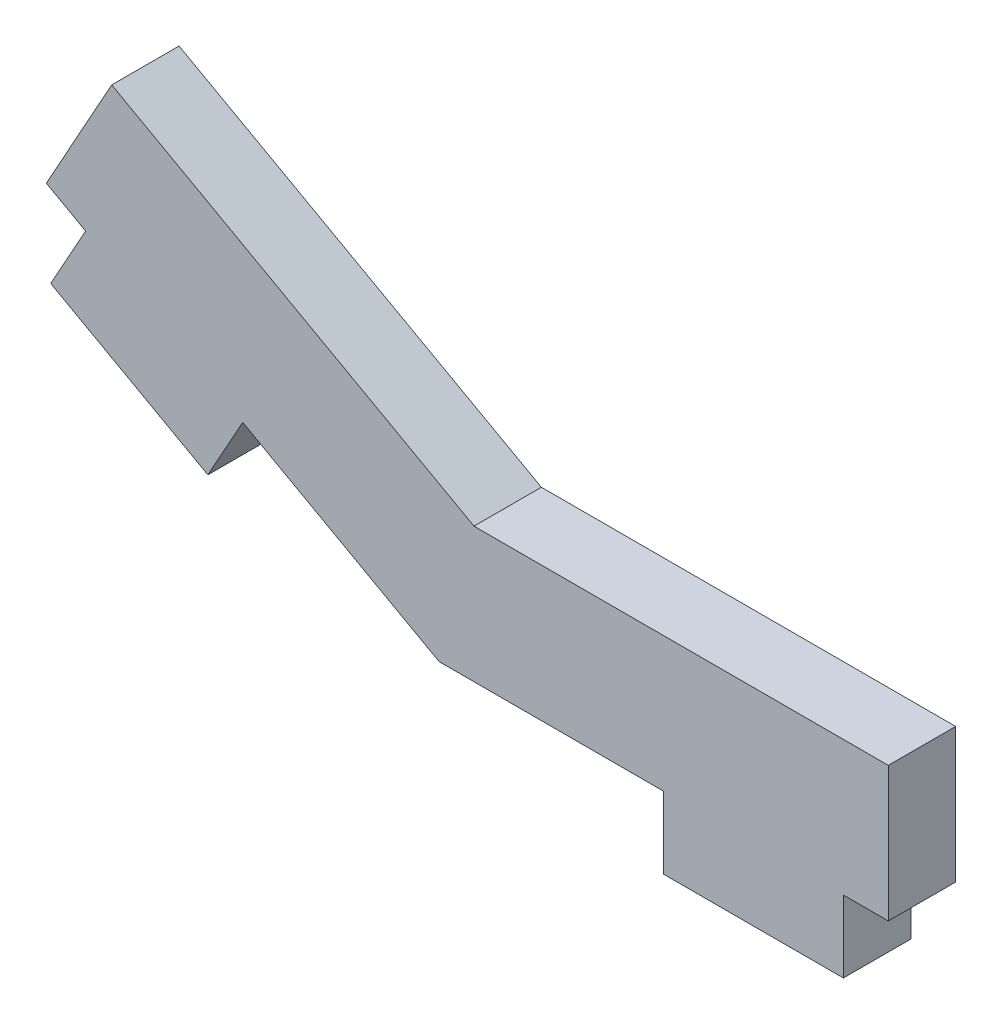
from build123d import *

# Parameters (mm, degrees)
EXTRUDE_1_DEPTH = 3
SKETCH_1_3_W    = 8
SKETCH_1_3_H    = 3.2
EXTRUDE_2_DEPTH = 3


with BuildPart() as part:
    # Sketch 1 → Extrude 1 (new body)
    with BuildSketch(Plane.XY):
        Polygon((20, 6), (20, 0), (0, 0), (-17.489008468, 9.702297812), (-14.578319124, 14.949000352), (1.552822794, 6), align=None)
    extrude(amount=EXTRUDE_1_DEPTH)

    # Sketch 1_3 → Extrude 2 (add)
    with BuildSketch(Plane.XY):
        Polygon((-10.296871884, 2.052907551), (-8.744504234, 4.851148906), (-15.740107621, 8.73206803), (-17.292475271, 5.933826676), align=None)
        with Locations((14, -1.6)):
            Rectangle(SKETCH_1_3_W, SKETCH_1_3_H)
    extrude(amount=EXTRUDE_2_DEPTH)


solid = part.part
